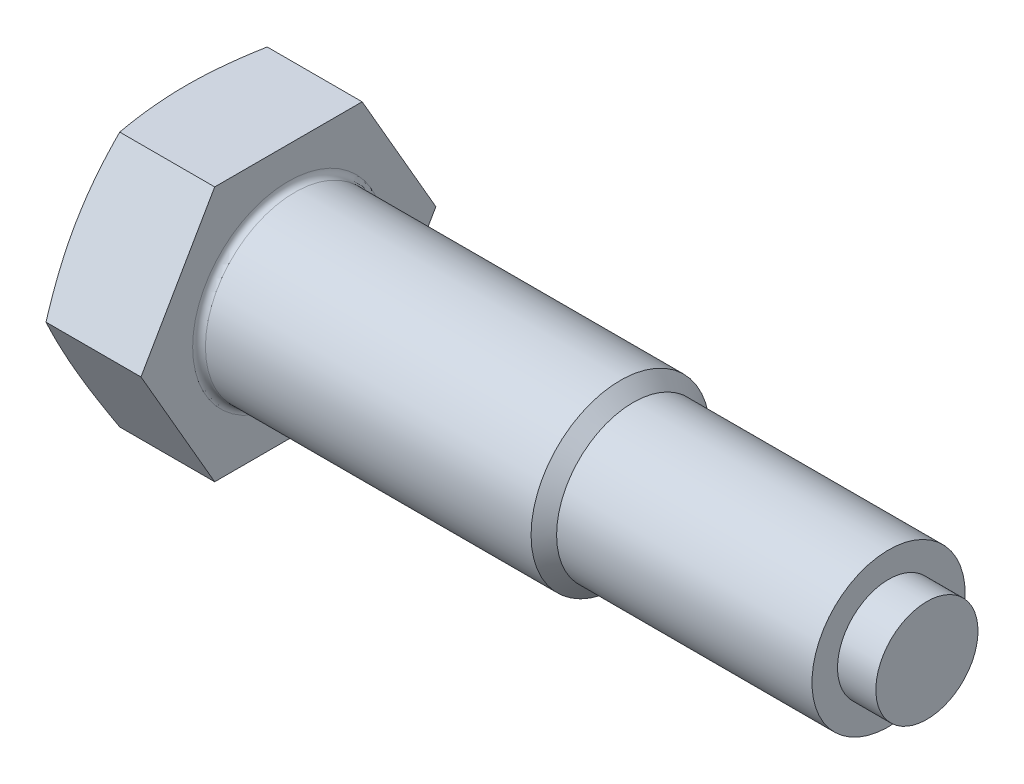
ISO-10303-21;
HEADER;
FILE_DESCRIPTION(('STEP AP214'),'2;1');
FILE_NAME('part.step','',(''),(''),'','','');
FILE_SCHEMA(('AUTOMOTIVE_DESIGN { 1 0 10303 214 1 1 1 1 }'));
ENDSEC;
DATA;
#1=APPLICATION_CONTEXT('core data for automotive mechanical design processes');
#2=APPLICATION_PROTOCOL_DEFINITION('international standard','automotive_design',2000,#1);
#3=PRODUCT_CONTEXT('',#1,'mechanical');
#4=PRODUCT('Part','Part','',(#3));
#5=PRODUCT_RELATED_PRODUCT_CATEGORY('part','',(#4));
#6=PRODUCT_DEFINITION_FORMATION('','',#4);
#7=PRODUCT_DEFINITION_CONTEXT('part definition',#1,'design');
#8=PRODUCT_DEFINITION('design','',#6,#7);
#9=PRODUCT_DEFINITION_SHAPE('','',#8);
#10=(LENGTH_UNIT() NAMED_UNIT(*) SI_UNIT(.MILLI.,.METRE.));
#11=(NAMED_UNIT(*) PLANE_ANGLE_UNIT() SI_UNIT($,.RADIAN.));
#12=(NAMED_UNIT(*) SI_UNIT($,.STERADIAN.) SOLID_ANGLE_UNIT());
#13=UNCERTAINTY_MEASURE_WITH_UNIT(LENGTH_MEASURE(1.E-05),#10,'distance_accuracy_value','');
#14=(GEOMETRIC_REPRESENTATION_CONTEXT(3) GLOBAL_UNCERTAINTY_ASSIGNED_CONTEXT((#13)) GLOBAL_UNIT_ASSIGNED_CONTEXT((#10,
#11,#12)) REPRESENTATION_CONTEXT('',''));
#15=CARTESIAN_POINT('',(0.,0.,0.));
#16=DIRECTION('',(0.,0.,1.));
#17=DIRECTION('',(1.,0.,0.));
#18=AXIS2_PLACEMENT_3D('',#15,#16,#17);
#19=CARTESIAN_POINT('',(4.,-5.,-2.88675134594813));
#20=DIRECTION('',(0.,0.5,0.866025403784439));
#21=DIRECTION('',(0.,-0.866025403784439,0.5));
#22=AXIS2_PLACEMENT_3D('',#19,#20,#21);
#23=PLANE('',#22);
#24=CARTESIAN_POINT('',(0.281573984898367,0.000199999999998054,-5.7736181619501));
#25=CARTESIAN_POINT('',(0.238042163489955,-0.206877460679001,-5.65406193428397));
#26=CARTESIAN_POINT('',(0.198442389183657,-0.414637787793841,-5.5341114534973));
#27=CARTESIAN_POINT('',(0.128772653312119,-0.831509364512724,-5.29343053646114));
#28=CARTESIAN_POINT('',(0.098710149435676,-1.04062154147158,-5.17269956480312));
#29=CARTESIAN_POINT('',(0.0500848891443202,-1.45787607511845,-4.93179754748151));
#30=CARTESIAN_POINT('',(0.0314160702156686,-1.66600890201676,-4.81163200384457));
#31=CARTESIAN_POINT('',(0.0063759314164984,-2.08276129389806,-4.57101989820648));
#32=CARTESIAN_POINT('',(0.,-2.29138064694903,-4.45057345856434));
#33=CARTESIAN_POINT('',(0.,-2.70861935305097,-4.20968057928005));
#34=CARTESIAN_POINT('',(0.0063759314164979,-2.91723870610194,-4.08923413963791));
#35=CARTESIAN_POINT('',(0.0314160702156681,-3.33399109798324,-3.84862203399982));
#36=CARTESIAN_POINT('',(0.05008488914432,-3.54212392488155,-3.72845649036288));
#37=CARTESIAN_POINT('',(0.098710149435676,-3.95937845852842,-3.48755447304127));
#38=CARTESIAN_POINT('',(0.128772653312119,-4.16849063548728,-3.36682350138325));
#39=CARTESIAN_POINT('',(0.198442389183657,-4.58536221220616,-3.1261425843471));
#40=CARTESIAN_POINT('',(0.238042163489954,-4.793122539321,-3.00619210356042));
#41=CARTESIAN_POINT('',(0.281573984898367,-5.0002,-2.88663587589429));
#42=B_SPLINE_CURVE_WITH_KNOTS('',3,(#24,#25,#26,#27,#28,#29,#30,#31,#32,#33,#34,#35,#36,#37,#38,
#39,#40,#41),.UNSPECIFIED.,.F.,.F.,(4,2,2,2,2,2,2,2,4),(0.,0.729203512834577,1.45897583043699,
2.18184682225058,2.90444658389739,3.6270463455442,4.34991733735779,5.0796896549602,
5.80889316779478),.UNSPECIFIED.);
#43=CARTESIAN_POINT('',(0.281531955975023,0.,-5.77350269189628));
#44=VERTEX_POINT('',#43);
#45=CARTESIAN_POINT('',(0.,-2.5,-4.33012701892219));
#46=VERTEX_POINT('',#45);
#47=EDGE_CURVE('E121',#44,#46,#42,.T.);
#48=ORIENTED_EDGE('',*,*,#47,.F.);
#49=DIRECTION('',(-1.,0.,0.));
#50=VECTOR('',#49,1.);
#51=CARTESIAN_POINT('',(4.,0.,-5.77350269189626));
#52=LINE('',#51,#50);
#53=CARTESIAN_POINT('',(4.,0.,-5.77350269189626));
#54=VERTEX_POINT('',#53);
#55=EDGE_CURVE('E150',#54,#44,#52,.T.);
#56=ORIENTED_EDGE('',*,*,#55,.F.);
#57=DIRECTION('',(0.,0.866025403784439,-0.5));
#58=VECTOR('',#57,1.);
#59=CARTESIAN_POINT('',(4.,-5.,-2.88675134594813));
#60=LINE('',#59,#58);
#61=CARTESIAN_POINT('',(4.,-5.,-2.88675134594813));
#62=VERTEX_POINT('',#61);
#63=EDGE_CURVE('E186',#62,#54,#60,.T.);
#64=ORIENTED_EDGE('',*,*,#63,.F.);
#65=DIRECTION('',(-1.,0.,0.));
#66=VECTOR('',#65,1.);
#67=CARTESIAN_POINT('',(4.,-5.,-2.88675134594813));
#68=LINE('',#67,#66);
#69=CARTESIAN_POINT('',(0.281531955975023,-5.,-2.88675134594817));
#70=VERTEX_POINT('',#69);
#71=EDGE_CURVE('E144',#62,#70,#68,.T.);
#72=ORIENTED_EDGE('',*,*,#71,.T.);
#73=EDGE_CURVE('E208',#46,#70,#42,.T.);
#74=ORIENTED_EDGE('',*,*,#73,.F.);
#75=EDGE_LOOP('',(#48,#56,#64,#72,#74));
#76=FACE_BOUND('',#75,.T.);
#77=ADVANCED_FACE('F39',(#76),#23,.F.);
#78=CARTESIAN_POINT('',(4.,0.,-5.77350269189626));
#79=DIRECTION('',(0.,-0.5,0.866025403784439));
#80=DIRECTION('',(0.,-0.866025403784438,-0.5));
#81=AXIS2_PLACEMENT_3D('',#78,#79,#80);
#82=PLANE('',#81);
#83=CARTESIAN_POINT('',(0.281573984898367,5.0002,-2.88663587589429));
#84=CARTESIAN_POINT('',(0.238042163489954,4.793122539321,-3.00619210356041));
#85=CARTESIAN_POINT('',(0.198442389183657,4.58536221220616,-3.12614258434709));
#86=CARTESIAN_POINT('',(0.128772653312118,4.16849063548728,-3.36682350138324));
#87=CARTESIAN_POINT('',(0.0987101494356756,3.95937845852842,-3.48755447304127));
#88=CARTESIAN_POINT('',(0.0500848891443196,3.54212392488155,-3.72845649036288));
#89=CARTESIAN_POINT('',(0.0314160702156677,3.33399109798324,-3.84862203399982));
#90=CARTESIAN_POINT('',(0.00637593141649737,2.91723870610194,-4.0892341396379));
#91=CARTESIAN_POINT('',(0.,2.70861935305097,-4.20968057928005));
#92=CARTESIAN_POINT('',(0.,2.29138064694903,-4.45057345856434));
#93=CARTESIAN_POINT('',(0.00637593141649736,2.08276129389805,-4.57101989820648));
#94=CARTESIAN_POINT('',(0.0314160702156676,1.66600890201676,-4.81163200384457));
#95=CARTESIAN_POINT('',(0.0500848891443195,1.45787607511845,-4.93179754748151));
#96=CARTESIAN_POINT('',(0.0987101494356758,1.04062154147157,-5.17269956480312));
#97=CARTESIAN_POINT('',(0.128772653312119,0.831509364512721,-5.29343053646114));
#98=CARTESIAN_POINT('',(0.198442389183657,0.414637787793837,-5.5341114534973));
#99=CARTESIAN_POINT('',(0.238042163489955,0.206877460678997,-5.65406193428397));
#100=CARTESIAN_POINT('',(0.281573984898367,-0.000200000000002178,-5.7736181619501));
#101=B_SPLINE_CURVE_WITH_KNOTS('',3,(#83,#84,#85,#86,#87,#88,#89,#90,#91,#92,#93,#94,#95,#96,
#97,#98,#99,#100),.UNSPECIFIED.,.F.,.F.,(4,2,2,2,2,2,2,2,4),(0.,0.729203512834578,
1.45897583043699,2.18184682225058,2.90444658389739,3.6270463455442,4.3499173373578,
5.07968965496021,5.80889316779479),.UNSPECIFIED.);
#102=CARTESIAN_POINT('',(0.281531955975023,5.,-2.88675134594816));
#103=VERTEX_POINT('',#102);
#104=CARTESIAN_POINT('',(0.,2.5,-4.33012701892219));
#105=VERTEX_POINT('',#104);
#106=EDGE_CURVE('E260',#103,#105,#101,.T.);
#107=ORIENTED_EDGE('',*,*,#106,.F.);
#108=DIRECTION('',(-1.,0.,0.));
#109=VECTOR('',#108,1.);
#110=CARTESIAN_POINT('',(4.,5.,-2.88675134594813));
#111=LINE('',#110,#109);
#112=CARTESIAN_POINT('',(4.,5.,-2.88675134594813));
#113=VERTEX_POINT('',#112);
#114=EDGE_CURVE('E141',#113,#103,#111,.T.);
#115=ORIENTED_EDGE('',*,*,#114,.F.);
#116=DIRECTION('',(0.,0.866025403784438,0.5));
#117=VECTOR('',#116,1.);
#118=CARTESIAN_POINT('',(4.,0.,-5.77350269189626));
#119=LINE('',#118,#117);
#120=EDGE_CURVE('E189',#54,#113,#119,.T.);
#121=ORIENTED_EDGE('',*,*,#120,.F.);
#122=ORIENTED_EDGE('',*,*,#55,.T.);
#123=EDGE_CURVE('E133',#105,#44,#101,.T.);
#124=ORIENTED_EDGE('',*,*,#123,.F.);
#125=EDGE_LOOP('',(#107,#115,#121,#122,#124));
#126=FACE_BOUND('',#125,.T.);
#127=ADVANCED_FACE('F266',(#126),#82,.F.);
#128=CARTESIAN_POINT('',(4.,5.,-2.88675134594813));
#129=DIRECTION('',(0.,-1.,0.));
#130=DIRECTION('',(0.,0.,-1.));
#131=AXIS2_PLACEMENT_3D('',#128,#129,#130);
#132=PLANE('',#131);
#133=CARTESIAN_POINT('',(1.50439512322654,5.,-7.64310251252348));
#134=CARTESIAN_POINT('',(1.43551180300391,5.,-7.41688443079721));
#135=CARTESIAN_POINT('',(1.3674322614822,5.,-7.19041704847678));
#136=CARTESIAN_POINT('',(1.23332538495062,5.,-6.73685676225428));
#137=CARTESIAN_POINT('',(1.16729821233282,5.,-6.50976381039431));
#138=CARTESIAN_POINT('',(1.03763088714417,5.,-6.05443677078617));
#139=CARTESIAN_POINT('',(0.973995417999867,5.,-5.82620134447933));
#140=CARTESIAN_POINT('',(0.849856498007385,5.,-5.36888148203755));
#141=CARTESIAN_POINT('',(0.789352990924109,5.,-5.13979706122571));
#142=CARTESIAN_POINT('',(0.672973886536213,5.,-4.68345086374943));
#143=CARTESIAN_POINT('',(0.617050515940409,5.,-4.45620133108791));
#144=CARTESIAN_POINT('',(0.509968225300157,5.,-4.00058448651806));
#145=CARTESIAN_POINT('',(0.458809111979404,5.,-3.77221722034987));
#146=CARTESIAN_POINT('',(0.362442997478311,5.,-3.31429429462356));
#147=CARTESIAN_POINT('',(0.317234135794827,5.,-3.08473902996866));
#148=CARTESIAN_POINT('',(0.23414684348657,5.,-2.62429577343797));
#149=CARTESIAN_POINT('',(0.196268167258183,5.,-2.3934078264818));
#150=CARTESIAN_POINT('',(0.133130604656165,5.,-1.95629809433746));
#151=CARTESIAN_POINT('',(0.106932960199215,5.,-1.75021318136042));
#152=CARTESIAN_POINT('',(0.062586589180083,5.,-1.33717192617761));
#153=CARTESIAN_POINT('',(0.0444376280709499,5.,-1.13021560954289));
#154=CARTESIAN_POINT('',(0.0170626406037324,5.,-0.715851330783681));
#155=CARTESIAN_POINT('',(0.0078303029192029,5.,-0.508443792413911));
#156=CARTESIAN_POINT('',(-0.00124400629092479,5.,-0.093421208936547));
#157=CARTESIAN_POINT('',(-0.00108604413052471,5.,0.114193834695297));
#158=CARTESIAN_POINT('',(0.00863625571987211,5.,0.530253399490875));
#159=CARTESIAN_POINT('',(0.0182482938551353,5.,0.738696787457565));
#160=CARTESIAN_POINT('',(0.0464363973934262,5.,1.15497131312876));
#161=CARTESIAN_POINT('',(0.0650126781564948,5.,1.3628024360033));
#162=CARTESIAN_POINT('',(0.110260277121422,5.,1.77774980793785));
#163=CARTESIAN_POINT('',(0.136938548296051,5.,1.98486528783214));
#164=CARTESIAN_POINT('',(0.197307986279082,5.,2.39806009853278));
#165=CARTESIAN_POINT('',(0.230999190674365,5.,2.60413942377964));
#166=CARTESIAN_POINT('',(0.30623674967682,5.,3.02610647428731));
#167=CARTESIAN_POINT('',(0.348104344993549,5.,3.24193641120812));
#168=CARTESIAN_POINT('',(0.437228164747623,5.,3.67248794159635));
#169=CARTESIAN_POINT('',(0.484484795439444,5.,3.8872094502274));
#170=CARTESIAN_POINT('',(0.583394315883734,5.,4.31569716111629));
#171=CARTESIAN_POINT('',(0.635048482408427,5.,4.52946306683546));
#172=CARTESIAN_POINT('',(0.741913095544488,5.,4.9560942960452));
#173=CARTESIAN_POINT('',(0.797123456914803,5.,5.16895964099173));
#174=CARTESIAN_POINT('',(0.910507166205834,5.,5.59418863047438));
#175=CARTESIAN_POINT('',(0.968684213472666,5.,5.80655128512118));
#176=CARTESIAN_POINT('',(1.0874086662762,5.,6.23061420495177));
#177=CARTESIAN_POINT('',(1.14795610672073,5.,6.44231446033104));
#178=CARTESIAN_POINT('',(1.33247422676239,5.,7.07649472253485));
#179=CARTESIAN_POINT('',(1.45934162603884,5.,7.49813135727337));
#180=CARTESIAN_POINT('',(1.71694117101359,5.,8.33511686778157));
#181=CARTESIAN_POINT('',(1.84761520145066,5.,8.75048377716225));
#182=CARTESIAN_POINT('',(2.1126779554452,5.,9.5800502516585));
#183=CARTESIAN_POINT('',(2.24706685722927,5.,9.99424975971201));
#184=CARTESIAN_POINT('',(2.51803451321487,5.,10.8201887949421));
#185=CARTESIAN_POINT('',(2.65460302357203,5.,11.2319316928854));
#186=CARTESIAN_POINT('',(2.9297876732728,5.,12.0546955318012));
#187=CARTESIAN_POINT('',(3.06840364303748,5.,12.4657165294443));
#188=CARTESIAN_POINT('',(3.20773627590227,5.,12.8764911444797));
#189=B_SPLINE_CURVE_WITH_KNOTS('',3,(#133,#134,#135,#136,#137,#138,#139,#140,#141,#142,#143,
#144,#145,#146,#147,#148,#149,#150,#151,#152,#153,#154,#155,#156,#157,#158,#159,#160,#161,#162,
#163,#164,#165,#166,#167,#168,#169,#170,#171,#172,#173,#174,#175,#176,#177,#178,#179,#180,#181,
#182,#183,#184,#185,#186,#187,#188),.UNSPECIFIED.,.F.,.F.,(4,2,2,2,2,2,2,2,2,2,2,2,2,2,2,2,2,2,
2,2,2,2,2,2,2,2,2,4),(0.,0.709424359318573,1.4189047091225,2.12970877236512,2.8405000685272,
3.54254782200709,4.24456708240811,4.94636631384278,5.64814202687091,6.27123531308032,
6.89431044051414,7.51694422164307,8.13957360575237,8.76536065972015,9.39116274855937,
10.0175034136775,10.64384743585,11.3033228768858,11.9628480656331,12.6225653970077,
13.2822669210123,13.9428122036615,14.6033672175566,15.9242375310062,17.2305282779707,
18.5368818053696,19.8382785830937,21.139568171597),.UNSPECIFIED.);
#190=CARTESIAN_POINT('',(0.281531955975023,5.00000000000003,2.88675134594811));
#191=VERTEX_POINT('',#190);
#192=CARTESIAN_POINT('',(0.,5.,0.));
#193=VERTEX_POINT('',#192);
#194=EDGE_CURVE('E450',#191,#193,#189,.F.);
#195=ORIENTED_EDGE('',*,*,#194,.F.);
#196=DIRECTION('',(-1.,0.,0.));
#197=VECTOR('',#196,1.);
#198=CARTESIAN_POINT('',(4.,5.,2.88675134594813));
#199=LINE('',#198,#197);
#200=CARTESIAN_POINT('',(4.,5.,2.88675134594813));
#201=VERTEX_POINT('',#200);
#202=EDGE_CURVE('E138',#201,#191,#199,.T.);
#203=ORIENTED_EDGE('',*,*,#202,.F.);
#204=DIRECTION('',(0.,0.,1.));
#205=VECTOR('',#204,1.);
#206=CARTESIAN_POINT('',(4.,5.,-2.88675134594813));
#207=LINE('',#206,#205);
#208=EDGE_CURVE('E196',#113,#201,#207,.T.);
#209=ORIENTED_EDGE('',*,*,#208,.F.);
#210=ORIENTED_EDGE('',*,*,#114,.T.);
#211=EDGE_CURVE('E261',#193,#103,#189,.F.);
#212=ORIENTED_EDGE('',*,*,#211,.F.);
#213=EDGE_LOOP('',(#195,#203,#209,#210,#212));
#214=FACE_BOUND('',#213,.T.);
#215=ADVANCED_FACE('F269',(#214),#132,.F.);
#216=CARTESIAN_POINT('',(4.,5.,2.88675134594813));
#217=DIRECTION('',(0.,-0.5,-0.866025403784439));
#218=DIRECTION('',(0.,0.866025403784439,-0.5));
#219=AXIS2_PLACEMENT_3D('',#216,#217,#218);
#220=PLANE('',#219);
#221=CARTESIAN_POINT('',(0.281573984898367,-0.0002,5.7736181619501));
#222=CARTESIAN_POINT('',(0.238042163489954,0.206877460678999,5.65406193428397));
#223=CARTESIAN_POINT('',(0.198442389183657,0.414637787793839,5.5341114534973));
#224=CARTESIAN_POINT('',(0.128772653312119,0.831509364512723,5.29343053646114));
#225=CARTESIAN_POINT('',(0.0987101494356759,1.04062154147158,5.17269956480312));
#226=CARTESIAN_POINT('',(0.0500848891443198,1.45787607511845,4.93179754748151));
#227=CARTESIAN_POINT('',(0.031416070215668,1.66600890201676,4.81163200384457));
#228=CARTESIAN_POINT('',(0.00637593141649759,2.08276129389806,4.57101989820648));
#229=CARTESIAN_POINT('',(0.,2.29138064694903,4.45057345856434));
#230=CARTESIAN_POINT('',(0.,2.70861935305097,4.20968057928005));
#231=CARTESIAN_POINT('',(0.0063759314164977,2.91723870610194,4.0892341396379));
#232=CARTESIAN_POINT('',(0.031416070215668,3.33399109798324,3.84862203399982));
#233=CARTESIAN_POINT('',(0.0500848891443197,3.54212392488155,3.72845649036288));
#234=CARTESIAN_POINT('',(0.0987101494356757,3.95937845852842,3.48755447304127));
#235=CARTESIAN_POINT('',(0.128772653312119,4.16849063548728,3.36682350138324));
#236=CARTESIAN_POINT('',(0.198442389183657,4.58536221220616,3.12614258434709));
#237=CARTESIAN_POINT('',(0.238042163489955,4.793122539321,3.00619210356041));
#238=CARTESIAN_POINT('',(0.281573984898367,5.0002,2.88663587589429));
#239=B_SPLINE_CURVE_WITH_KNOTS('',3,(#221,#222,#223,#224,#225,#226,#227,#228,#229,#230,#231,
#232,#233,#234,#235,#236,#237,#238),.UNSPECIFIED.,.F.,.F.,(4,2,2,2,2,2,2,2,4),(0.,
0.729203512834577,1.45897583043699,2.18184682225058,2.90444658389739,3.6270463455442,
4.3499173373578,5.07968965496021,5.80889316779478),.UNSPECIFIED.);
#240=CARTESIAN_POINT('',(0.281531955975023,0.,5.77350269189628));
#241=VERTEX_POINT('',#240);
#242=CARTESIAN_POINT('',(0.,2.5,4.33012701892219));
#243=VERTEX_POINT('',#242);
#244=EDGE_CURVE('E115',#241,#243,#239,.T.);
#245=ORIENTED_EDGE('',*,*,#244,.F.);
#246=DIRECTION('',(-1.,0.,0.));
#247=VECTOR('',#246,1.);
#248=CARTESIAN_POINT('',(4.,0.,5.77350269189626));
#249=LINE('',#248,#247);
#250=CARTESIAN_POINT('',(4.,0.,5.77350269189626));
#251=VERTEX_POINT('',#250);
#252=EDGE_CURVE('E129',#251,#241,#249,.T.);
#253=ORIENTED_EDGE('',*,*,#252,.F.);
#254=DIRECTION('',(0.,-0.866025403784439,0.5));
#255=VECTOR('',#254,1.);
#256=CARTESIAN_POINT('',(4.,5.,2.88675134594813));
#257=LINE('',#256,#255);
#258=EDGE_CURVE('E198',#201,#251,#257,.T.);
#259=ORIENTED_EDGE('',*,*,#258,.F.);
#260=ORIENTED_EDGE('',*,*,#202,.T.);
#261=EDGE_CURVE('E132',#243,#191,#239,.T.);
#262=ORIENTED_EDGE('',*,*,#261,.F.);
#263=EDGE_LOOP('',(#245,#253,#259,#260,#262));
#264=FACE_BOUND('',#263,.T.);
#265=ADVANCED_FACE('F127',(#264),#220,.F.);
#266=CARTESIAN_POINT('',(4.,0.,5.77350269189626));
#267=DIRECTION('',(0.,0.5,-0.866025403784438));
#268=DIRECTION('',(0.,0.866025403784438,0.5));
#269=AXIS2_PLACEMENT_3D('',#266,#267,#268);
#270=PLANE('',#269);
#271=CARTESIAN_POINT('',(0.281573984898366,-5.0002,2.88663587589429));
#272=CARTESIAN_POINT('',(0.238042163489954,-4.793122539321,3.00619210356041));
#273=CARTESIAN_POINT('',(0.198442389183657,-4.58536221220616,3.12614258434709));
#274=CARTESIAN_POINT('',(0.128772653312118,-4.16849063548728,3.36682350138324));
#275=CARTESIAN_POINT('',(0.0987101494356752,-3.95937845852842,3.48755447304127));
#276=CARTESIAN_POINT('',(0.0500848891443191,-3.54212392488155,3.72845649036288));
#277=CARTESIAN_POINT('',(0.0314160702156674,-3.33399109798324,3.84862203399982));
#278=CARTESIAN_POINT('',(0.00637593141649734,-2.91723870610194,4.0892341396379));
#279=CARTESIAN_POINT('',(0.,-2.70861935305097,4.20968057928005));
#280=CARTESIAN_POINT('',(0.,-2.29138064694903,4.45057345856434));
#281=CARTESIAN_POINT('',(0.00637593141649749,-2.08276129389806,4.57101989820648));
#282=CARTESIAN_POINT('',(0.0314160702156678,-1.66600890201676,4.81163200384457));
#283=CARTESIAN_POINT('',(0.0500848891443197,-1.45787607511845,4.93179754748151));
#284=CARTESIAN_POINT('',(0.0987101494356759,-1.04062154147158,5.17269956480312));
#285=CARTESIAN_POINT('',(0.128772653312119,-0.831509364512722,5.29343053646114));
#286=CARTESIAN_POINT('',(0.198442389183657,-0.414637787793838,5.5341114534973));
#287=CARTESIAN_POINT('',(0.238042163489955,-0.206877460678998,5.65406193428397));
#288=CARTESIAN_POINT('',(0.281573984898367,0.000200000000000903,5.7736181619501));
#289=B_SPLINE_CURVE_WITH_KNOTS('',3,(#271,#272,#273,#274,#275,#276,#277,#278,#279,#280,#281,
#282,#283,#284,#285,#286,#287,#288),.UNSPECIFIED.,.F.,.F.,(4,2,2,2,2,2,2,2,4),(0.,
0.729203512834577,1.45897583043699,2.18184682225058,2.90444658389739,3.6270463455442,
4.3499173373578,5.07968965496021,5.80889316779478),.UNSPECIFIED.);
#290=CARTESIAN_POINT('',(0.281531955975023,-5.,2.88675134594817));
#291=VERTEX_POINT('',#290);
#292=CARTESIAN_POINT('',(0.,-2.5,4.33012701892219));
#293=VERTEX_POINT('',#292);
#294=EDGE_CURVE('E123',#291,#293,#289,.T.);
#295=ORIENTED_EDGE('',*,*,#294,.F.);
#296=DIRECTION('',(-1.,0.,0.));
#297=VECTOR('',#296,1.);
#298=CARTESIAN_POINT('',(4.,-5.,2.88675134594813));
#299=LINE('',#298,#297);
#300=CARTESIAN_POINT('',(4.,-5.,2.88675134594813));
#301=VERTEX_POINT('',#300);
#302=EDGE_CURVE('E139',#301,#291,#299,.T.);
#303=ORIENTED_EDGE('',*,*,#302,.F.);
#304=DIRECTION('',(0.,-0.866025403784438,-0.5));
#305=VECTOR('',#304,1.);
#306=CARTESIAN_POINT('',(4.,0.,5.77350269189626));
#307=LINE('',#306,#305);
#308=EDGE_CURVE('E137',#251,#301,#307,.T.);
#309=ORIENTED_EDGE('',*,*,#308,.F.);
#310=ORIENTED_EDGE('',*,*,#252,.T.);
#311=EDGE_CURVE('E112',#293,#241,#289,.T.);
#312=ORIENTED_EDGE('',*,*,#311,.F.);
#313=EDGE_LOOP('',(#295,#303,#309,#310,#312));
#314=FACE_BOUND('',#313,.T.);
#315=ADVANCED_FACE('F135',(#314),#270,.F.);
#316=CARTESIAN_POINT('',(4.,-5.,2.88675134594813));
#317=DIRECTION('',(0.,1.,0.));
#318=DIRECTION('',(0.,0.,1.));
#319=AXIS2_PLACEMENT_3D('',#316,#317,#318);
#320=PLANE('',#319);
#321=CARTESIAN_POINT('',(1.50439512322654,-5.,-7.64310251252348));
#322=CARTESIAN_POINT('',(1.43551180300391,-5.,-7.41688443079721));
#323=CARTESIAN_POINT('',(1.3674322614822,-5.,-7.19041704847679));
#324=CARTESIAN_POINT('',(1.23332538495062,-5.,-6.73685676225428));
#325=CARTESIAN_POINT('',(1.16729821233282,-5.,-6.50976381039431));
#326=CARTESIAN_POINT('',(1.03763088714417,-5.,-6.05443677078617));
#327=CARTESIAN_POINT('',(0.973995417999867,-5.,-5.82620134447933));
#328=CARTESIAN_POINT('',(0.849856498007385,-5.,-5.36888148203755));
#329=CARTESIAN_POINT('',(0.789352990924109,-5.,-5.13979706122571));
#330=CARTESIAN_POINT('',(0.672973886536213,-5.,-4.68345086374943));
#331=CARTESIAN_POINT('',(0.61705051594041,-5.,-4.45620133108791));
#332=CARTESIAN_POINT('',(0.509968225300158,-5.,-4.00058448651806));
#333=CARTESIAN_POINT('',(0.458809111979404,-5.,-3.77221722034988));
#334=CARTESIAN_POINT('',(0.362442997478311,-5.,-3.31429429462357));
#335=CARTESIAN_POINT('',(0.317234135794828,-5.,-3.08473902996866));
#336=CARTESIAN_POINT('',(0.23414684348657,-5.,-2.62429577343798));
#337=CARTESIAN_POINT('',(0.196268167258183,-5.,-2.39340782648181));
#338=CARTESIAN_POINT('',(0.133130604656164,-5.,-1.95629809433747));
#339=CARTESIAN_POINT('',(0.106932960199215,-5.,-1.75021318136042));
#340=CARTESIAN_POINT('',(0.0625865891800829,-5.,-1.33717192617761));
#341=CARTESIAN_POINT('',(0.0444376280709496,-5.,-1.13021560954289));
#342=CARTESIAN_POINT('',(0.0170626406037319,-5.,-0.715851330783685));
#343=CARTESIAN_POINT('',(0.00783030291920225,-5.,-0.508443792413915));
#344=CARTESIAN_POINT('',(-0.00124400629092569,-5.,-0.093421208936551));
#345=CARTESIAN_POINT('',(-0.00108604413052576,-5.,0.114193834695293));
#346=CARTESIAN_POINT('',(0.00863625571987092,-5.,0.530253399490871));
#347=CARTESIAN_POINT('',(0.0182482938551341,-5.,0.738696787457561));
#348=CARTESIAN_POINT('',(0.046436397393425,-5.,1.15497131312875));
#349=CARTESIAN_POINT('',(0.0650126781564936,-5.,1.36280243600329));
#350=CARTESIAN_POINT('',(0.110260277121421,-5.,1.77774980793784));
#351=CARTESIAN_POINT('',(0.13693854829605,-5.,1.98486528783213));
#352=CARTESIAN_POINT('',(0.197307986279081,-5.,2.39806009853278));
#353=CARTESIAN_POINT('',(0.230999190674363,-5.,2.60413942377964));
#354=CARTESIAN_POINT('',(0.306236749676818,-5.,3.0261064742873));
#355=CARTESIAN_POINT('',(0.348104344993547,-5.,3.24193641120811));
#356=CARTESIAN_POINT('',(0.437228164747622,-5.,3.67248794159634));
#357=CARTESIAN_POINT('',(0.484484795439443,-5.,3.88720945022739));
#358=CARTESIAN_POINT('',(0.583394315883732,-5.,4.31569716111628));
#359=CARTESIAN_POINT('',(0.635048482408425,-5.,4.52946306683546));
#360=CARTESIAN_POINT('',(0.741913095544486,-5.,4.95609429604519));
#361=CARTESIAN_POINT('',(0.797123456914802,-5.,5.16895964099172));
#362=CARTESIAN_POINT('',(0.910507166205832,-5.,5.59418863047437));
#363=CARTESIAN_POINT('',(0.968684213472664,-5.,5.80655128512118));
#364=CARTESIAN_POINT('',(1.0874086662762,-5.,6.23061420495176));
#365=CARTESIAN_POINT('',(1.14795610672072,-5.,6.44231446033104));
#366=CARTESIAN_POINT('',(1.33247422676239,-5.,7.07649472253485));
#367=CARTESIAN_POINT('',(1.45934162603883,-5.,7.49813135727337));
#368=CARTESIAN_POINT('',(1.71694117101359,-5.,8.33511686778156));
#369=CARTESIAN_POINT('',(1.84761520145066,-5.,8.75048377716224));
#370=CARTESIAN_POINT('',(2.1126779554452,-5.,9.5800502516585));
#371=CARTESIAN_POINT('',(2.24706685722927,-5.,9.99424975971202));
#372=CARTESIAN_POINT('',(2.51803451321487,-5.,10.8201887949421));
#373=CARTESIAN_POINT('',(2.65460302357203,-5.,11.2319316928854));
#374=CARTESIAN_POINT('',(2.9297876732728,-5.,12.0546955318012));
#375=CARTESIAN_POINT('',(3.06840364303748,-5.,12.4657165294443));
#376=CARTESIAN_POINT('',(3.20773627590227,-5.,12.8764911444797));
#377=B_SPLINE_CURVE_WITH_KNOTS('',3,(#321,#322,#323,#324,#325,#326,#327,#328,#329,#330,#331,
#332,#333,#334,#335,#336,#337,#338,#339,#340,#341,#342,#343,#344,#345,#346,#347,#348,#349,#350,
#351,#352,#353,#354,#355,#356,#357,#358,#359,#360,#361,#362,#363,#364,#365,#366,#367,#368,#369,
#370,#371,#372,#373,#374,#375,#376),.UNSPECIFIED.,.F.,.F.,(4,2,2,2,2,2,2,2,2,2,2,2,2,2,2,2,2,2,
2,2,2,2,2,2,2,2,2,4),(0.,0.709424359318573,1.4189047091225,2.12970877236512,2.8405000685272,
3.54254782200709,4.2445670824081,4.94636631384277,5.64814202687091,6.27123531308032,
6.89431044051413,7.51694422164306,8.13957360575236,8.76536065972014,9.39116274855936,
10.0175034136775,10.64384743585,11.3033228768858,11.9628480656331,12.6225653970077,
13.2822669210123,13.9428122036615,14.6033672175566,15.9242375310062,17.2305282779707,
18.5368818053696,19.8382785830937,21.139568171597),.UNSPECIFIED.);
#378=CARTESIAN_POINT('',(0.,-5.,0.));
#379=VERTEX_POINT('',#378);
#380=EDGE_CURVE('E216',#70,#379,#377,.T.);
#381=ORIENTED_EDGE('',*,*,#380,.F.);
#382=ORIENTED_EDGE('',*,*,#71,.F.);
#383=DIRECTION('',(0.,0.,-1.));
#384=VECTOR('',#383,1.);
#385=CARTESIAN_POINT('',(4.,-5.,2.88675134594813));
#386=LINE('',#385,#384);
#387=EDGE_CURVE('E201',#301,#62,#386,.T.);
#388=ORIENTED_EDGE('',*,*,#387,.F.);
#389=ORIENTED_EDGE('',*,*,#302,.T.);
#390=EDGE_CURVE('E217',#379,#291,#377,.T.);
#391=ORIENTED_EDGE('',*,*,#390,.F.);
#392=EDGE_LOOP('',(#381,#382,#388,#389,#391));
#393=FACE_BOUND('',#392,.T.);
#394=ADVANCED_FACE('F213',(#393),#320,.F.);
#395=CARTESIAN_POINT('',(62.4852813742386,0.,0.));
#396=DIRECTION('',(-1.,0.,0.));
#397=DIRECTION('',(0.,0.,1.));
#398=AXIS2_PLACEMENT_3D('',#395,#396,#397);
#399=CYLINDRICAL_SURFACE('',#398,3.);
#400=CARTESIAN_POINT('',(17.5,0.,0.));
#401=DIRECTION('',(1.,0.,0.));
#402=DIRECTION('',(0.,0.,-1.));
#403=AXIS2_PLACEMENT_3D('',#400,#401,#402);
#404=CIRCLE('',#403,3.);
#405=CARTESIAN_POINT('',(17.5,0.,-3.));
#406=VERTEX_POINT('',#405);
#407=EDGE_CURVE('E13',#406,#406,#404,.T.);
#408=ORIENTED_EDGE('',*,*,#407,.T.);
#409=EDGE_LOOP('',(#408));
#410=FACE_BOUND('',#409,.T.);
#411=CARTESIAN_POINT('',(27.5,0.,0.));
#412=DIRECTION('',(1.,0.,0.));
#413=DIRECTION('',(0.,0.,-1.));
#414=AXIS2_PLACEMENT_3D('',#411,#412,#413);
#415=CIRCLE('',#414,3.);
#416=CARTESIAN_POINT('',(27.5,0.,-3.));
#417=VERTEX_POINT('',#416);
#418=EDGE_CURVE('E153',#417,#417,#415,.T.);
#419=ORIENTED_EDGE('',*,*,#418,.F.);
#420=EDGE_LOOP('',(#419));
#421=FACE_BOUND('',#420,.T.);
#422=ADVANCED_FACE('F303',(#410,#421),#399,.T.);
#423=CARTESIAN_POINT('',(4.,-10.,0.));
#424=DIRECTION('',(-1.,0.,0.));
#425=DIRECTION('',(0.,0.,1.));
#426=AXIS2_PLACEMENT_3D('',#423,#424,#425);
#427=PLANE('',#426);
#428=CARTESIAN_POINT('',(4.,0.,0.));
#429=DIRECTION('',(-1.,0.,0.));
#430=DIRECTION('',(0.,0.,1.));
#431=AXIS2_PLACEMENT_3D('',#428,#429,#430);
#432=CIRCLE('',#431,3.75);
#433=CARTESIAN_POINT('',(4.,0.,3.75));
#434=VERTEX_POINT('',#433);
#435=EDGE_CURVE('E47',#434,#434,#432,.T.);
#436=ORIENTED_EDGE('',*,*,#435,.T.);
#437=EDGE_LOOP('',(#436));
#438=FACE_BOUND('',#437,.T.);
#439=ORIENTED_EDGE('',*,*,#63,.T.);
#440=ORIENTED_EDGE('',*,*,#120,.T.);
#441=ORIENTED_EDGE('',*,*,#208,.T.);
#442=ORIENTED_EDGE('',*,*,#258,.T.);
#443=ORIENTED_EDGE('',*,*,#308,.T.);
#444=ORIENTED_EDGE('',*,*,#387,.T.);
#445=EDGE_LOOP('',(#439,#440,#441,#442,#443,#444));
#446=FACE_BOUND('',#445,.T.);
#447=ADVANCED_FACE('F169',(#438,#446),#427,.F.);
#448=CARTESIAN_POINT('',(17.,0.,0.));
#449=DIRECTION('',(-1.,0.,0.));
#450=DIRECTION('',(0.,0.,1.));
#451=AXIS2_PLACEMENT_3D('',#448,#449,#450);
#452=CYLINDRICAL_SURFACE('',#451,3.5);
#453=CARTESIAN_POINT('',(4.25,0.,0.));
#454=DIRECTION('',(-1.,0.,0.));
#455=DIRECTION('',(0.,0.,1.));
#456=AXIS2_PLACEMENT_3D('',#453,#454,#455);
#457=CIRCLE('',#456,3.5);
#458=CARTESIAN_POINT('',(4.25,0.,3.5));
#459=VERTEX_POINT('',#458);
#460=EDGE_CURVE('E161',#459,#459,#457,.F.);
#461=CARTESIAN_POINT('',(17.,0.,0.));
#462=DIRECTION('',(1.,0.,0.));
#463=DIRECTION('',(0.,0.,-1.));
#464=AXIS2_PLACEMENT_3D('',#461,#462,#463);
#465=CIRCLE('',#464,3.5);
#466=CARTESIAN_POINT('',(17.,0.,3.5));
#467=VERTEX_POINT('',#466);
#468=EDGE_CURVE('E156',#467,#467,#465,.T.);
#469=CARTESIAN_POINT('',(4.25,0.,3.5));
#470=CARTESIAN_POINT('',(4.3828125,0.,3.5));
#471=CARTESIAN_POINT('',(4.515625,0.,3.5));
#472=CARTESIAN_POINT('',(4.78125,0.,3.5));
#473=CARTESIAN_POINT('',(4.9140625,0.,3.5));
#474=CARTESIAN_POINT('',(5.1796875,0.,3.5));
#475=CARTESIAN_POINT('',(5.3125,0.,3.5));
#476=CARTESIAN_POINT('',(5.578125,0.,3.5));
#477=CARTESIAN_POINT('',(5.7109375,0.,3.5));
#478=CARTESIAN_POINT('',(5.9765625,0.,3.5));
#479=CARTESIAN_POINT('',(6.109375,0.,3.5));
#480=CARTESIAN_POINT('',(6.375,0.,3.5));
#481=CARTESIAN_POINT('',(6.5078125,0.,3.5));
#482=CARTESIAN_POINT('',(6.7734375,0.,3.5));
#483=CARTESIAN_POINT('',(6.90625,0.,3.5));
#484=CARTESIAN_POINT('',(7.171875,0.,3.5));
#485=CARTESIAN_POINT('',(7.3046875,0.,3.5));
#486=CARTESIAN_POINT('',(7.5703125,0.,3.5));
#487=CARTESIAN_POINT('',(7.703125,0.,3.5));
#488=CARTESIAN_POINT('',(7.96875,0.,3.5));
#489=CARTESIAN_POINT('',(8.1015625,0.,3.5));
#490=CARTESIAN_POINT('',(8.3671875,0.,3.5));
#491=CARTESIAN_POINT('',(8.5,0.,3.5));
#492=CARTESIAN_POINT('',(8.765625,0.,3.5));
#493=CARTESIAN_POINT('',(8.8984375,0.,3.5));
#494=CARTESIAN_POINT('',(9.1640625,0.,3.5));
#495=CARTESIAN_POINT('',(9.296875,0.,3.5));
#496=CARTESIAN_POINT('',(9.5625,0.,3.5));
#497=CARTESIAN_POINT('',(9.6953125,0.,3.5));
#498=CARTESIAN_POINT('',(9.9609375,0.,3.5));
#499=CARTESIAN_POINT('',(10.09375,0.,3.5));
#500=CARTESIAN_POINT('',(10.359375,0.,3.5));
#501=CARTESIAN_POINT('',(10.4921875,0.,3.5));
#502=CARTESIAN_POINT('',(10.7578125,0.,3.5));
#503=CARTESIAN_POINT('',(10.890625,0.,3.5));
#504=CARTESIAN_POINT('',(11.15625,0.,3.5));
#505=CARTESIAN_POINT('',(11.2890625,0.,3.5));
#506=CARTESIAN_POINT('',(11.5546875,0.,3.5));
#507=CARTESIAN_POINT('',(11.6875,0.,3.5));
#508=CARTESIAN_POINT('',(11.953125,0.,3.5));
#509=CARTESIAN_POINT('',(12.0859375,0.,3.5));
#510=CARTESIAN_POINT('',(12.3515625,0.,3.5));
#511=CARTESIAN_POINT('',(12.484375,0.,3.5));
#512=CARTESIAN_POINT('',(12.75,0.,3.5));
#513=CARTESIAN_POINT('',(12.8828125,0.,3.5));
#514=CARTESIAN_POINT('',(13.1484375,0.,3.5));
#515=CARTESIAN_POINT('',(13.28125,0.,3.5));
#516=CARTESIAN_POINT('',(13.546875,0.,3.5));
#517=CARTESIAN_POINT('',(13.6796875,0.,3.5));
#518=CARTESIAN_POINT('',(13.9453125,0.,3.5));
#519=CARTESIAN_POINT('',(14.078125,0.,3.5));
#520=CARTESIAN_POINT('',(14.34375,0.,3.5));
#521=CARTESIAN_POINT('',(14.4765625,0.,3.5));
#522=CARTESIAN_POINT('',(14.7421875,0.,3.5));
#523=CARTESIAN_POINT('',(14.875,0.,3.5));
#524=CARTESIAN_POINT('',(15.140625,0.,3.5));
#525=CARTESIAN_POINT('',(15.2734375,0.,3.5));
#526=CARTESIAN_POINT('',(15.5390625,0.,3.5));
#527=CARTESIAN_POINT('',(15.671875,0.,3.5));
#528=CARTESIAN_POINT('',(15.9375,0.,3.5));
#529=CARTESIAN_POINT('',(16.0703125,0.,3.5));
#530=CARTESIAN_POINT('',(16.3359375,0.,3.5));
#531=CARTESIAN_POINT('',(16.46875,0.,3.5));
#532=CARTESIAN_POINT('',(16.734375,0.,3.5));
#533=CARTESIAN_POINT('',(16.8671875,0.,3.5));
#534=CARTESIAN_POINT('',(17.,0.,3.5));
#535=B_SPLINE_CURVE_WITH_KNOTS('',3,(#469,#470,#471,#472,#473,#474,#475,#476,#477,#478,#479,
#480,#481,#482,#483,#484,#485,#486,#487,#488,#489,#490,#491,#492,#493,#494,#495,#496,#497,#498,
#499,#500,#501,#502,#503,#504,#505,#506,#507,#508,#509,#510,#511,#512,#513,#514,#515,#516,#517,
#518,#519,#520,#521,#522,#523,#524,#525,#526,#527,#528,#529,#530,#531,#532,#533,#534),
.UNSPECIFIED.,.F.,.F.,(4,2,2,2,2,2,2,2,2,2,2,2,2,2,2,2,2,2,2,2,2,2,2,2,2,2,2,2,2,2,2,2,4),(0.,
0.3984375,0.796875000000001,1.1953125,1.59375,1.9921875,2.390625,2.7890625,3.1875,3.5859375,
3.984375,4.3828125,4.78125,5.1796875,5.578125,5.9765625,6.375,6.7734375,7.171875,7.5703125,
7.96875,8.3671875,8.765625,9.1640625,9.5625,9.9609375,10.359375,10.7578125,11.15625,11.5546875,
11.953125,12.3515625,12.75),.UNSPECIFIED.);
#536=EDGE_CURVE('BSEAM178',#459,#467,#535,.T.);
#537=ORIENTED_EDGE('',*,*,#460,.T.);
#538=ORIENTED_EDGE('',*,*,#468,.F.);
#539=ORIENTED_EDGE('',*,*,#536,.T.);
#540=ORIENTED_EDGE('',*,*,#536,.F.);
#541=EDGE_LOOP('',(#537,#539,#538,#540));
#542=FACE_BOUND('',#541,.T.);
#543=ADVANCED_FACE('F178',(#542),#452,.T.);
#544=CARTESIAN_POINT('',(27.5,0.,0.));
#545=DIRECTION('',(1.,0.,0.));
#546=DIRECTION('',(0.,0.,-1.));
#547=AXIS2_PLACEMENT_3D('',#544,#545,#546);
#548=PLANE('',#547);
#549=CARTESIAN_POINT('',(27.5,0.,0.));
#550=DIRECTION('',(1.,0.,0.));
#551=DIRECTION('',(0.,0.,-1.));
#552=AXIS2_PLACEMENT_3D('',#549,#550,#551);
#553=CIRCLE('',#552,2.);
#554=CARTESIAN_POINT('',(27.5,0.,-2.));
#555=VERTEX_POINT('',#554);
#556=EDGE_CURVE('E157',#555,#555,#553,.T.);
#557=ORIENTED_EDGE('',*,*,#556,.F.);
#558=EDGE_LOOP('',(#557));
#559=FACE_BOUND('',#558,.T.);
#560=ORIENTED_EDGE('',*,*,#418,.T.);
#561=EDGE_LOOP('',(#560));
#562=FACE_BOUND('',#561,.T.);
#563=ADVANCED_FACE('F181',(#559,#562),#548,.T.);
#564=CARTESIAN_POINT('',(27.5,0.,0.));
#565=DIRECTION('',(1.,0.,0.));
#566=DIRECTION('',(0.,0.,-1.));
#567=AXIS2_PLACEMENT_3D('',#564,#565,#566);
#568=CYLINDRICAL_SURFACE('',#567,2.);
#569=ORIENTED_EDGE('',*,*,#556,.T.);
#570=EDGE_LOOP('',(#569));
#571=FACE_BOUND('',#570,.T.);
#572=CARTESIAN_POINT('',(29.,0.,0.));
#573=DIRECTION('',(1.,0.,0.));
#574=DIRECTION('',(0.,0.,-1.));
#575=AXIS2_PLACEMENT_3D('',#572,#573,#574);
#576=CIRCLE('',#575,2.);
#577=CARTESIAN_POINT('',(29.,0.,-2.));
#578=VERTEX_POINT('',#577);
#579=EDGE_CURVE('E192',#578,#578,#576,.T.);
#580=ORIENTED_EDGE('',*,*,#579,.F.);
#581=EDGE_LOOP('',(#580));
#582=FACE_BOUND('',#581,.T.);
#583=ADVANCED_FACE('F239',(#571,#582),#568,.T.);
#584=CARTESIAN_POINT('',(29.,-10.,0.));
#585=DIRECTION('',(-1.,0.,0.));
#586=DIRECTION('',(0.,0.,1.));
#587=AXIS2_PLACEMENT_3D('',#584,#585,#586);
#588=PLANE('',#587);
#589=ORIENTED_EDGE('',*,*,#579,.T.);
#590=EDGE_LOOP('',(#589));
#591=FACE_BOUND('',#590,.T.);
#592=ADVANCED_FACE('F333',(#591),#588,.F.);
#593=CARTESIAN_POINT('',(0.,0.,0.));
#594=DIRECTION('',(1.,0.,0.));
#595=DIRECTION('',(0.,0.,-1.));
#596=AXIS2_PLACEMENT_3D('',#593,#594,#595);
#597=CONICAL_SURFACE('',#596,5.,1.22173047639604);
#598=ORIENTED_EDGE('',*,*,#244,.T.);
#599=CARTESIAN_POINT('',(0.,0.,0.));
#600=DIRECTION('',(-1.,0.,0.));
#601=DIRECTION('',(0.,0.,1.));
#602=AXIS2_PLACEMENT_3D('',#599,#600,#601);
#603=CIRCLE('',#602,5.);
#604=EDGE_CURVE('E117',#293,#243,#603,.T.);
#605=ORIENTED_EDGE('',*,*,#604,.F.);
#606=ORIENTED_EDGE('',*,*,#311,.T.);
#607=EDGE_LOOP('',(#598,#605,#606));
#608=FACE_BOUND('',#607,.T.);
#609=ADVANCED_FACE('F114',(#608),#597,.T.);
#610=ORIENTED_EDGE('',*,*,#294,.T.);
#611=EDGE_CURVE('E159',#379,#293,#603,.T.);
#612=ORIENTED_EDGE('',*,*,#611,.F.);
#613=ORIENTED_EDGE('',*,*,#390,.T.);
#614=EDGE_LOOP('',(#610,#612,#613));
#615=FACE_BOUND('',#614,.T.);
#616=ADVANCED_FACE('F238',(#615),#597,.T.);
#617=ORIENTED_EDGE('',*,*,#73,.T.);
#618=ORIENTED_EDGE('',*,*,#380,.T.);
#619=EDGE_CURVE('E62',#46,#379,#603,.T.);
#620=ORIENTED_EDGE('',*,*,#619,.F.);
#621=EDGE_LOOP('',(#617,#618,#620));
#622=FACE_BOUND('',#621,.T.);
#623=ADVANCED_FACE('F345',(#622),#597,.T.);
#624=ORIENTED_EDGE('',*,*,#123,.T.);
#625=ORIENTED_EDGE('',*,*,#47,.T.);
#626=EDGE_CURVE('E441',#105,#46,#603,.T.);
#627=ORIENTED_EDGE('',*,*,#626,.F.);
#628=EDGE_LOOP('',(#624,#625,#627));
#629=FACE_BOUND('',#628,.T.);
#630=ADVANCED_FACE('F346',(#629),#597,.T.);
#631=ORIENTED_EDGE('',*,*,#211,.T.);
#632=ORIENTED_EDGE('',*,*,#106,.T.);
#633=EDGE_CURVE('E160',#193,#105,#603,.T.);
#634=ORIENTED_EDGE('',*,*,#633,.F.);
#635=EDGE_LOOP('',(#631,#632,#634));
#636=FACE_BOUND('',#635,.T.);
#637=ADVANCED_FACE('F237',(#636),#597,.T.);
#638=ORIENTED_EDGE('',*,*,#194,.T.);
#639=CARTESIAN_POINT('',(0.,0.,0.));
#640=DIRECTION('',(-1.,0.,0.));
#641=DIRECTION('',(0.,0.,1.));
#642=AXIS2_PLACEMENT_3D('',#639,#640,#641);
#643=CIRCLE('',#642,5.);
#644=EDGE_CURVE('E54',#243,#193,#643,.T.);
#645=ORIENTED_EDGE('',*,*,#644,.F.);
#646=ORIENTED_EDGE('',*,*,#261,.T.);
#647=EDGE_LOOP('',(#638,#645,#646));
#648=FACE_BOUND('',#647,.T.);
#649=ADVANCED_FACE('F233',(#648),#597,.T.);
#650=CARTESIAN_POINT('',(0.,-10.,0.));
#651=DIRECTION('',(-1.,0.,0.));
#652=DIRECTION('',(0.,0.,1.));
#653=AXIS2_PLACEMENT_3D('',#650,#651,#652);
#654=PLANE('',#653);
#655=ORIENTED_EDGE('',*,*,#604,.T.);
#656=ORIENTED_EDGE('',*,*,#644,.T.);
#657=ORIENTED_EDGE('',*,*,#633,.T.);
#658=ORIENTED_EDGE('',*,*,#626,.T.);
#659=ORIENTED_EDGE('',*,*,#619,.T.);
#660=ORIENTED_EDGE('',*,*,#611,.T.);
#661=EDGE_LOOP('',(#655,#656,#657,#658,#659,#660));
#662=FACE_BOUND('',#661,.T.);
#663=ADVANCED_FACE('F175',(#662),#654,.T.);
#664=CARTESIAN_POINT('',(4.25,0.,0.));
#665=DIRECTION('',(-1.,0.,0.));
#666=DIRECTION('',(0.,0.,1.));
#667=AXIS2_PLACEMENT_3D('',#664,#665,#666);
#668=TOROIDAL_SURFACE('',#667,3.75,0.25);
#669=ORIENTED_EDGE('',*,*,#435,.F.);
#670=EDGE_LOOP('',(#669));
#671=FACE_BOUND('',#670,.T.);
#672=ORIENTED_EDGE('',*,*,#460,.F.);
#673=EDGE_LOOP('',(#672));
#674=FACE_BOUND('',#673,.T.);
#675=ADVANCED_FACE('F172',(#671,#674),#668,.F.);
#676=CARTESIAN_POINT('',(17.5,0.,0.));
#677=DIRECTION('',(-1.,0.,0.));
#678=DIRECTION('',(0.,0.,1.));
#679=AXIS2_PLACEMENT_3D('',#676,#677,#678);
#680=CONICAL_SURFACE('',#679,3.,0.785398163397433);
#681=ORIENTED_EDGE('',*,*,#468,.T.);
#682=EDGE_LOOP('',(#681));
#683=FACE_BOUND('',#682,.T.);
#684=ORIENTED_EDGE('',*,*,#407,.F.);
#685=EDGE_LOOP('',(#684));
#686=FACE_BOUND('',#685,.T.);
#687=ADVANCED_FACE('F41',(#683,#686),#680,.T.);
#688=CLOSED_SHELL('',(#77,#127,#215,#265,#315,#394,#422,#447,#543,#563,#583,#592,#609,#616,#623,
#630,#637,#649,#663,#675,#687));
#689=MANIFOLD_SOLID_BREP('B2',#688);
#690=ADVANCED_BREP_SHAPE_REPRESENTATION('',(#18,#689),#14);
#691=SHAPE_DEFINITION_REPRESENTATION(#9,#690);
ENDSEC;
END-ISO-10303-21;
